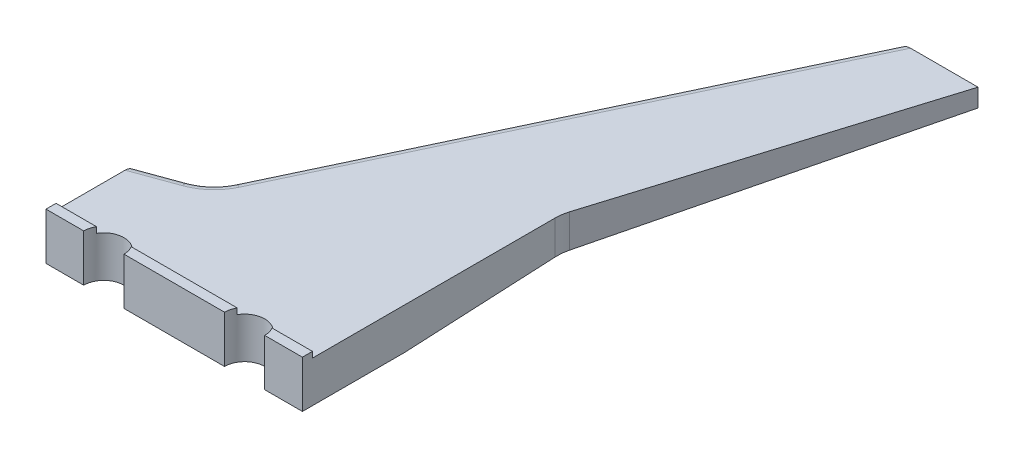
ISO-10303-21;
HEADER;
FILE_DESCRIPTION(('STEP AP214'),'2;1');
FILE_NAME('part.step','',(''),(''),'','','');
FILE_SCHEMA(('AUTOMOTIVE_DESIGN { 1 0 10303 214 1 1 1 1 }'));
ENDSEC;
DATA;
#1=APPLICATION_CONTEXT('core data for automotive mechanical design processes');
#2=APPLICATION_PROTOCOL_DEFINITION('international standard','automotive_design',2000,#1);
#3=PRODUCT_CONTEXT('',#1,'mechanical');
#4=PRODUCT('Part','Part','',(#3));
#5=PRODUCT_RELATED_PRODUCT_CATEGORY('part','',(#4));
#6=PRODUCT_DEFINITION_FORMATION('','',#4);
#7=PRODUCT_DEFINITION_CONTEXT('part definition',#1,'design');
#8=PRODUCT_DEFINITION('design','',#6,#7);
#9=PRODUCT_DEFINITION_SHAPE('','',#8);
#10=(LENGTH_UNIT() NAMED_UNIT(*) SI_UNIT(.MILLI.,.METRE.));
#11=(NAMED_UNIT(*) PLANE_ANGLE_UNIT() SI_UNIT($,.RADIAN.));
#12=(NAMED_UNIT(*) SI_UNIT($,.STERADIAN.) SOLID_ANGLE_UNIT());
#13=UNCERTAINTY_MEASURE_WITH_UNIT(LENGTH_MEASURE(1.E-05),#10,'distance_accuracy_value','');
#14=(GEOMETRIC_REPRESENTATION_CONTEXT(3) GLOBAL_UNCERTAINTY_ASSIGNED_CONTEXT((#13)) GLOBAL_UNIT_ASSIGNED_CONTEXT((#10,
#11,#12)) REPRESENTATION_CONTEXT('',''));
#15=CARTESIAN_POINT('',(0.,0.,0.));
#16=DIRECTION('',(0.,0.,1.));
#17=DIRECTION('',(1.,0.,0.));
#18=AXIS2_PLACEMENT_3D('',#15,#16,#17);
#19=CARTESIAN_POINT('',(62.5957803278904,9.35562767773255,15.8508650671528));
#20=DIRECTION('',(0.,0.,-1.));
#21=DIRECTION('',(-1.,0.,0.));
#22=AXIS2_PLACEMENT_3D('',#19,#20,#21);
#23=PLANE('',#22);
#24=DIRECTION('',(0.,-1.,0.));
#25=VECTOR('',#24,1.);
#26=CARTESIAN_POINT('',(42.9641016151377,9.35562767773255,15.8508650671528));
#27=LINE('',#26,#25);
#28=CARTESIAN_POINT('',(42.9641016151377,9.35562767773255,15.8508650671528));
#29=VERTEX_POINT('',#28);
#30=CARTESIAN_POINT('',(42.9641016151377,8.2,15.8508650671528));
#31=VERTEX_POINT('',#30);
#32=EDGE_CURVE('E722',#29,#31,#27,.T.);
#33=ORIENTED_EDGE('',*,*,#32,.F.);
#34=DIRECTION('',(-1.,0.,0.));
#35=VECTOR('',#34,1.);
#36=CARTESIAN_POINT('',(62.5957803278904,9.35562767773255,15.8508650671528));
#37=LINE('',#36,#35);
#38=CARTESIAN_POINT('',(51.,9.35562767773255,15.8508650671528));
#39=VERTEX_POINT('',#38);
#40=EDGE_CURVE('E438',#39,#29,#37,.T.);
#41=ORIENTED_EDGE('',*,*,#40,.F.);
#42=DIRECTION('',(0.,1.,0.));
#43=VECTOR('',#42,1.);
#44=CARTESIAN_POINT('',(51.,9.35562767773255,15.8508650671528));
#45=LINE('',#44,#43);
#46=CARTESIAN_POINT('',(51.,8.2,15.8508650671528));
#47=VERTEX_POINT('',#46);
#48=EDGE_CURVE('E454',#47,#39,#45,.T.);
#49=ORIENTED_EDGE('',*,*,#48,.F.);
#50=DIRECTION('',(-1.,0.,0.));
#51=VECTOR('',#50,1.);
#52=CARTESIAN_POINT('',(62.5957803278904,8.2,15.8508650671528));
#53=LINE('',#52,#51);
#54=EDGE_CURVE('E440',#47,#31,#53,.T.);
#55=ORIENTED_EDGE('',*,*,#54,.T.);
#56=EDGE_LOOP('',(#33,#41,#49,#55));
#57=FACE_BOUND('',#56,.T.);
#58=ADVANCED_FACE('F34',(#57),#23,.T.);
#59=CARTESIAN_POINT('',(62.5957803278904,9.35562767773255,17.8508650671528));
#60=DIRECTION('',(0.,1.,0.));
#61=DIRECTION('',(0.,0.,1.));
#62=AXIS2_PLACEMENT_3D('',#59,#60,#61);
#63=PLANE('',#62);
#64=CARTESIAN_POINT('',(39.5,9.35562767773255,17.8508650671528));
#65=DIRECTION('',(0.,-1.,0.));
#66=DIRECTION('',(0.,0.,-1.));
#67=AXIS2_PLACEMENT_3D('',#64,#65,#66);
#68=CIRCLE('',#67,4.00000000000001);
#69=CARTESIAN_POINT('',(43.5,9.35562767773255,17.8508650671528));
#70=VERTEX_POINT('',#69);
#71=EDGE_CURVE('E720',#29,#70,#68,.T.);
#72=ORIENTED_EDGE('',*,*,#71,.T.);
#73=DIRECTION('',(-1.,0.,0.));
#74=VECTOR('',#73,1.);
#75=CARTESIAN_POINT('',(62.5957803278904,9.35562767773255,17.8508650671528));
#76=LINE('',#75,#74);
#77=CARTESIAN_POINT('',(51.,9.35562767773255,17.8508650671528));
#78=VERTEX_POINT('',#77);
#79=EDGE_CURVE('E274',#78,#70,#76,.T.);
#80=ORIENTED_EDGE('',*,*,#79,.F.);
#81=DIRECTION('',(0.,0.,1.));
#82=VECTOR('',#81,1.);
#83=CARTESIAN_POINT('',(51.,9.35562767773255,17.8508650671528));
#84=LINE('',#83,#82);
#85=EDGE_CURVE('E449',#39,#78,#84,.T.);
#86=ORIENTED_EDGE('',*,*,#85,.F.);
#87=ORIENTED_EDGE('',*,*,#40,.T.);
#88=EDGE_LOOP('',(#72,#80,#86,#87));
#89=FACE_BOUND('',#88,.T.);
#90=ADVANCED_FACE('F392',(#89),#63,.T.);
#91=CARTESIAN_POINT('',(62.5957803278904,0.,17.8508650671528));
#92=DIRECTION('',(0.,0.,1.));
#93=DIRECTION('',(1.,0.,0.));
#94=AXIS2_PLACEMENT_3D('',#91,#92,#93);
#95=PLANE('',#94);
#96=DIRECTION('',(0.,-1.,0.));
#97=VECTOR('',#96,1.);
#98=CARTESIAN_POINT('',(35.5,9.35562767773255,17.8508650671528));
#99=LINE('',#98,#97);
#100=CARTESIAN_POINT('',(35.5,9.35562767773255,17.8508650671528));
#101=VERTEX_POINT('',#100);
#102=CARTESIAN_POINT('',(35.5,0.,17.8508650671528));
#103=VERTEX_POINT('',#102);
#104=EDGE_CURVE('E11',#101,#103,#99,.T.);
#105=ORIENTED_EDGE('',*,*,#104,.F.);
#106=CARTESIAN_POINT('',(15.5,9.35562767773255,17.8508650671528));
#107=VERTEX_POINT('',#106);
#108=EDGE_CURVE('E472',#101,#107,#76,.T.);
#109=ORIENTED_EDGE('',*,*,#108,.T.);
#110=DIRECTION('',(0.,-1.,0.));
#111=VECTOR('',#110,1.);
#112=CARTESIAN_POINT('',(15.5,9.35562767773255,17.8508650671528));
#113=LINE('',#112,#111);
#114=CARTESIAN_POINT('',(15.5,0.,17.8508650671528));
#115=VERTEX_POINT('',#114);
#116=EDGE_CURVE('E267',#115,#107,#113,.F.);
#117=ORIENTED_EDGE('',*,*,#116,.F.);
#118=DIRECTION('',(-1.,0.,0.));
#119=VECTOR('',#118,1.);
#120=CARTESIAN_POINT('',(62.5957803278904,0.,17.8508650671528));
#121=LINE('',#120,#119);
#122=EDGE_CURVE('E56',#103,#115,#121,.T.);
#123=ORIENTED_EDGE('',*,*,#122,.F.);
#124=EDGE_LOOP('',(#105,#109,#117,#123));
#125=FACE_BOUND('',#124,.T.);
#126=ADVANCED_FACE('F265',(#125),#95,.T.);
#127=DIRECTION('',(0.,-1.,0.));
#128=VECTOR('',#127,1.);
#129=CARTESIAN_POINT('',(36.0358983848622,9.35562767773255,15.8508650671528));
#130=LINE('',#129,#128);
#131=CARTESIAN_POINT('',(36.0358983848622,8.2,15.8508650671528));
#132=VERTEX_POINT('',#131);
#133=CARTESIAN_POINT('',(36.0358983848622,9.35562767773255,15.8508650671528));
#134=VERTEX_POINT('',#133);
#135=EDGE_CURVE('E719',#132,#134,#130,.F.);
#136=ORIENTED_EDGE('',*,*,#135,.F.);
#137=CARTESIAN_POINT('',(14.9641016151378,8.2,15.8508650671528));
#138=VERTEX_POINT('',#137);
#139=EDGE_CURVE('E437',#132,#138,#53,.T.);
#140=ORIENTED_EDGE('',*,*,#139,.T.);
#141=DIRECTION('',(0.,-1.,0.));
#142=VECTOR('',#141,1.);
#143=CARTESIAN_POINT('',(14.9641016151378,9.35562767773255,15.8508650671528));
#144=LINE('',#143,#142);
#145=CARTESIAN_POINT('',(14.9641016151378,9.35562767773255,15.8508650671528));
#146=VERTEX_POINT('',#145);
#147=EDGE_CURVE('E457',#146,#138,#144,.T.);
#148=ORIENTED_EDGE('',*,*,#147,.F.);
#149=EDGE_CURVE('E442',#134,#146,#37,.T.);
#150=ORIENTED_EDGE('',*,*,#149,.F.);
#151=EDGE_LOOP('',(#136,#140,#148,#150));
#152=FACE_BOUND('',#151,.T.);
#153=ADVANCED_FACE('F395',(#152),#23,.T.);
#154=EDGE_CURVE('E256',#101,#134,#68,.T.);
#155=ORIENTED_EDGE('',*,*,#154,.T.);
#156=ORIENTED_EDGE('',*,*,#149,.T.);
#157=CARTESIAN_POINT('',(11.5,9.35562767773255,17.8508650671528));
#158=DIRECTION('',(0.,-1.,0.));
#159=DIRECTION('',(0.,0.,-1.));
#160=AXIS2_PLACEMENT_3D('',#157,#158,#159);
#161=CIRCLE('',#160,4.);
#162=EDGE_CURVE('E429',#146,#107,#161,.T.);
#163=ORIENTED_EDGE('',*,*,#162,.T.);
#164=ORIENTED_EDGE('',*,*,#108,.F.);
#165=EDGE_LOOP('',(#155,#156,#163,#164));
#166=FACE_BOUND('',#165,.T.);
#167=ADVANCED_FACE('F402',(#166),#63,.T.);
#168=DIRECTION('',(0.,-1.,0.));
#169=VECTOR('',#168,1.);
#170=CARTESIAN_POINT('',(7.5,9.35562767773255,17.8508650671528));
#171=LINE('',#170,#169);
#172=CARTESIAN_POINT('',(7.5,9.35562767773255,17.8508650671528));
#173=VERTEX_POINT('',#172);
#174=CARTESIAN_POINT('',(7.5,0.,17.8508650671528));
#175=VERTEX_POINT('',#174);
#176=EDGE_CURVE('E479',#173,#175,#171,.T.);
#177=ORIENTED_EDGE('',*,*,#176,.F.);
#178=CARTESIAN_POINT('',(0.,9.35562767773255,17.8508650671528));
#179=VERTEX_POINT('',#178);
#180=EDGE_CURVE('E270',#173,#179,#76,.T.);
#181=ORIENTED_EDGE('',*,*,#180,.T.);
#182=DIRECTION('',(0.,1.,0.));
#183=VECTOR('',#182,1.);
#184=CARTESIAN_POINT('',(0.,0.,17.8508650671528));
#185=LINE('',#184,#183);
#186=CARTESIAN_POINT('',(0.,0.,17.8508650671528));
#187=VERTEX_POINT('',#186);
#188=EDGE_CURVE('E461',#187,#179,#185,.T.);
#189=ORIENTED_EDGE('',*,*,#188,.F.);
#190=EDGE_CURVE('E268',#175,#187,#121,.T.);
#191=ORIENTED_EDGE('',*,*,#190,.F.);
#192=EDGE_LOOP('',(#177,#181,#189,#191));
#193=FACE_BOUND('',#192,.T.);
#194=ADVANCED_FACE('F477',(#193),#95,.T.);
#195=CARTESIAN_POINT('',(51.,8.2,-33.7));
#196=DIRECTION('',(-0.955609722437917,0.,-0.294635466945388));
#197=DIRECTION('',(-0.294635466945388,0.,0.955609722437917));
#198=AXIS2_PLACEMENT_3D('',#195,#196,#197);
#199=PLANE('',#198);
#200=DIRECTION('',(0.,-1.,0.));
#201=VECTOR('',#200,1.);
#202=CARTESIAN_POINT('',(51.3773173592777,0.,-34.9237770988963));
#203=LINE('',#202,#201);
#204=CARTESIAN_POINT('',(51.3773173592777,8.2,-34.9237770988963));
#205=VERTEX_POINT('',#204);
#206=CARTESIAN_POINT('',(51.3773173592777,1.58970920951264,-34.9237770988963));
#207=VERTEX_POINT('',#206);
#208=EDGE_CURVE('E307',#205,#207,#203,.T.);
#209=ORIENTED_EDGE('',*,*,#208,.T.);
#210=CARTESIAN_POINT('',(51.3773173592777,1.58970920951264,-34.9237770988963));
#211=CARTESIAN_POINT('',(57.6017700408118,2.57295109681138,-55.1119355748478));
#212=CARTESIAN_POINT('',(63.826262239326,3.55329832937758,-75.3002222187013));
#213=CARTESIAN_POINT('',(70.2061227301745,4.55514254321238,-95.9924246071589));
#214=CARTESIAN_POINT('',(70.3614515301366,4.57953237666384,-96.4962122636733));
#215=CARTESIAN_POINT('',(70.5167803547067,4.60392040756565,-97.));
#216=B_SPLINE_CURVE_WITH_KNOTS('',3,(#210,#211,#212,#213,#214,#215),.UNSPECIFIED.,.F.,.F.,(4,2,
4),(0.,63.4464397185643,65.0297006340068),.UNSPECIFIED.);
#217=CARTESIAN_POINT('',(70.5167803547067,4.60392040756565,-97.));
#218=VERTEX_POINT('',#217);
#219=EDGE_CURVE('E344',#207,#218,#216,.T.);
#220=ORIENTED_EDGE('',*,*,#219,.T.);
#221=DIRECTION('',(0.,-1.,0.));
#222=VECTOR('',#221,1.);
#223=CARTESIAN_POINT('',(70.5167803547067,8.2,-97.));
#224=LINE('',#223,#222);
#225=CARTESIAN_POINT('',(70.5167803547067,8.2,-97.));
#226=VERTEX_POINT('',#225);
#227=EDGE_CURVE('E349',#226,#218,#224,.T.);
#228=ORIENTED_EDGE('',*,*,#227,.F.);
#229=DIRECTION('',(0.294635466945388,0.,-0.955609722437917));
#230=VECTOR('',#229,1.);
#231=CARTESIAN_POINT('',(51.,8.2,-33.7));
#232=LINE('',#231,#230);
#233=EDGE_CURVE('E657',#205,#226,#232,.T.);
#234=ORIENTED_EDGE('',*,*,#233,.F.);
#235=EDGE_LOOP('',(#209,#220,#228,#234));
#236=FACE_BOUND('',#235,.T.);
#237=ADVANCED_FACE('F332',(#236),#199,.F.);
#238=CARTESIAN_POINT('',(11.,8.2,-4.00367257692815));
#239=DIRECTION('',(0.342020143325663,0.,0.93969262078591));
#240=DIRECTION('',(0.939692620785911,0.,-0.342020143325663));
#241=AXIS2_PLACEMENT_3D('',#238,#239,#240);
#242=PLANE('',#241);
#243=DIRECTION('',(0.,-1.,0.));
#244=VECTOR('',#243,1.);
#245=CARTESIAN_POINT('',(1.31595971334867,8.2,-0.478970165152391));
#246=LINE('',#245,#244);
#247=CARTESIAN_POINT('',(1.31595971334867,0.,-0.478970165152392));
#248=VERTEX_POINT('',#247);
#249=CARTESIAN_POINT('',(1.31595971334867,6.2,-0.478970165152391));
#250=VERTEX_POINT('',#249);
#251=EDGE_CURVE('E357',#248,#250,#246,.F.);
#252=ORIENTED_EDGE('',*,*,#251,.T.);
#253=DIRECTION('',(-0.939692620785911,0.,0.342020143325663));
#254=VECTOR('',#253,1.);
#255=CARTESIAN_POINT('',(11.,6.2,-4.00367257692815));
#256=LINE('',#255,#254);
#257=CARTESIAN_POINT('',(7.71279497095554,6.2,-2.80722779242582));
#258=VERTEX_POINT('',#257);
#259=EDGE_CURVE('E557',#250,#258,#256,.F.);
#260=ORIENTED_EDGE('',*,*,#259,.T.);
#261=DIRECTION('',(0.,-1.,0.));
#262=VECTOR('',#261,1.);
#263=CARTESIAN_POINT('',(7.71279497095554,0.,-2.80722779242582));
#264=LINE('',#263,#262);
#265=CARTESIAN_POINT('',(7.71279497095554,0.,-2.80722779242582));
#266=VERTEX_POINT('',#265);
#267=EDGE_CURVE('E654',#258,#266,#264,.T.);
#268=ORIENTED_EDGE('',*,*,#267,.T.);
#269=DIRECTION('',(-0.93969262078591,0.,0.342020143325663));
#270=VECTOR('',#269,1.);
#271=CARTESIAN_POINT('',(11.,0.,-4.00367257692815));
#272=LINE('',#271,#270);
#273=EDGE_CURVE('E651',#266,#248,#272,.T.);
#274=ORIENTED_EDGE('',*,*,#273,.T.);
#275=EDGE_LOOP('',(#252,#260,#268,#274));
#276=FACE_BOUND('',#275,.T.);
#277=ADVANCED_FACE('F686',(#276),#242,.F.);
#278=CARTESIAN_POINT('',(51.,8.2,0.));
#279=DIRECTION('',(-1.,0.,0.));
#280=DIRECTION('',(0.,0.,1.));
#281=AXIS2_PLACEMENT_3D('',#278,#279,#280);
#282=PLANE('',#281);
#283=DIRECTION('',(0.,0.,-1.));
#284=VECTOR('',#283,1.);
#285=CARTESIAN_POINT('',(51.,0.,0.));
#286=LINE('',#285,#284);
#287=CARTESIAN_POINT('',(51.,0.,17.8508650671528));
#288=VERTEX_POINT('',#287);
#289=CARTESIAN_POINT('',(51.,0.,-2.46774148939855));
#290=VERTEX_POINT('',#289);
#291=EDGE_CURVE('E649',#288,#290,#286,.T.);
#292=ORIENTED_EDGE('',*,*,#291,.T.);
#293=CARTESIAN_POINT('',(51.,0.,-2.46774148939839));
#294=CARTESIAN_POINT('',(51.,0.128135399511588,-4.96342560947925));
#295=CARTESIAN_POINT('',(51.,0.254728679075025,-7.45918863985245));
#296=CARTESIAN_POINT('',(51.,0.505039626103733,-12.4508560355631));
#297=CARTESIAN_POINT('',(51.,0.628757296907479,-14.946760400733));
#298=CARTESIAN_POINT('',(51.,0.873526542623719,-19.9387118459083));
#299=CARTESIAN_POINT('',(51.,0.994578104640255,-22.4347589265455));
#300=CARTESIAN_POINT('',(51.,1.23415525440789,-27.4269772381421));
#301=CARTESIAN_POINT('',(51.,1.3526808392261,-29.9231484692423));
#302=CARTESIAN_POINT('',(51.,1.47001366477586,-32.4193756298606));
#303=B_SPLINE_CURVE_WITH_KNOTS('',3,(#293,#294,#295,#296,#297,#298,#299,#300,#301,#302),
.UNSPECIFIED.,.F.,.F.,(4,2,2,2,4),(0.,7.49691324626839,14.9938177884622,22.4907585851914,
29.9877080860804),.UNSPECIFIED.);
#304=CARTESIAN_POINT('',(51.,1.47001366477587,-32.4193756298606));
#305=VERTEX_POINT('',#304);
#306=EDGE_CURVE('E638',#290,#305,#303,.T.);
#307=ORIENTED_EDGE('',*,*,#306,.T.);
#308=DIRECTION('',(0.,-1.,0.));
#309=VECTOR('',#308,1.);
#310=CARTESIAN_POINT('',(51.,8.2,-32.4193756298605));
#311=LINE('',#310,#309);
#312=CARTESIAN_POINT('',(51.,8.2,-32.4193756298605));
#313=VERTEX_POINT('',#312);
#314=EDGE_CURVE('E353',#305,#313,#311,.F.);
#315=ORIENTED_EDGE('',*,*,#314,.T.);
#316=DIRECTION('',(0.,0.,-1.));
#317=VECTOR('',#316,1.);
#318=CARTESIAN_POINT('',(51.,8.2,0.));
#319=LINE('',#318,#317);
#320=EDGE_CURVE('E644',#47,#313,#319,.T.);
#321=ORIENTED_EDGE('',*,*,#320,.F.);
#322=ORIENTED_EDGE('',*,*,#48,.T.);
#323=ORIENTED_EDGE('',*,*,#85,.T.);
#324=DIRECTION('',(0.,-1.,0.));
#325=VECTOR('',#324,1.);
#326=CARTESIAN_POINT('',(51.,0.,17.8508650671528));
#327=LINE('',#326,#325);
#328=EDGE_CURVE('E445',#78,#288,#327,.T.);
#329=ORIENTED_EDGE('',*,*,#328,.T.);
#330=EDGE_LOOP('',(#292,#307,#315,#321,#322,#323,#329));
#331=FACE_BOUND('',#330,.T.);
#332=ADVANCED_FACE('F675',(#331),#282,.F.);
#333=CARTESIAN_POINT('',(54.8813851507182,8.2,-97.));
#334=DIRECTION('',(0.,0.,1.));
#335=DIRECTION('',(1.,0.,0.));
#336=AXIS2_PLACEMENT_3D('',#333,#334,#335);
#337=PLANE('',#336);
#338=CARTESIAN_POINT('',(70.5167803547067,4.60392040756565,-97.));
#339=CARTESIAN_POINT('',(69.6480622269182,4.59513245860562,-97.));
#340=CARTESIAN_POINT('',(68.7793535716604,4.58541360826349,-97.));
#341=CARTESIAN_POINT('',(67.0419664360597,4.56413689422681,-97.));
#342=CARTESIAN_POINT('',(66.1732879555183,4.5525790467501,-97.));
#343=CARTESIAN_POINT('',(64.435960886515,4.52764702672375,-97.));
#344=CARTESIAN_POINT('',(63.5673122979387,4.51427286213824,-97.));
#345=CARTESIAN_POINT('',(61.8300448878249,4.4857138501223,-97.));
#346=CARTESIAN_POINT('',(60.9614260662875,4.47052900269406,-97.));
#347=CARTESIAN_POINT('',(59.2242182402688,4.43834336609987,-97.));
#348=CARTESIAN_POINT('',(58.3556292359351,4.42134256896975,-97.));
#349=CARTESIAN_POINT('',(56.6184814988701,4.385502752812,-97.));
#350=CARTESIAN_POINT('',(55.7499227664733,4.36666371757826,-97.));
#351=CARTESIAN_POINT('',(54.8813851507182,4.34689454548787,-97.));
#352=B_SPLINE_CURVE_WITH_KNOTS('',3,(#338,#339,#340,#341,#342,#343,#344,#345,#346,#347,#348,
#349,#350,#351),.UNSPECIFIED.,.F.,.F.,(4,2,2,2,2,2,4),(0.,2.60628714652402,5.21255130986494,
7.81880404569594,10.425056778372,13.03132094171,15.637608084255),.UNSPECIFIED.);
#353=CARTESIAN_POINT('',(64.8813851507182,4.53396737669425,-97.));
#354=VERTEX_POINT('',#353);
#355=EDGE_CURVE('E666',#218,#354,#352,.T.);
#356=ORIENTED_EDGE('',*,*,#355,.T.);
#357=DIRECTION('',(0.,-1.,0.));
#358=VECTOR('',#357,1.);
#359=CARTESIAN_POINT('',(64.8813851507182,6.59689454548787,-97.));
#360=LINE('',#359,#358);
#361=CARTESIAN_POINT('',(64.8813851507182,6.59689454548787,-97.));
#362=VERTEX_POINT('',#361);
#363=EDGE_CURVE('E283',#362,#354,#360,.T.);
#364=ORIENTED_EDGE('',*,*,#363,.F.);
#365=DIRECTION('',(1.,0.,0.));
#366=VECTOR('',#365,1.);
#367=CARTESIAN_POINT('',(57.8813851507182,6.59689454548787,-97.));
#368=LINE('',#367,#366);
#369=CARTESIAN_POINT('',(57.8813851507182,6.59689454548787,-97.));
#370=VERTEX_POINT('',#369);
#371=EDGE_CURVE('E279',#370,#362,#368,.T.);
#372=ORIENTED_EDGE('',*,*,#371,.F.);
#373=DIRECTION('',(0.,1.,0.));
#374=VECTOR('',#373,1.);
#375=CARTESIAN_POINT('',(57.8813851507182,1.59689454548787,-97.));
#376=LINE('',#375,#374);
#377=CARTESIAN_POINT('',(57.8813851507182,4.41149486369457,-97.));
#378=VERTEX_POINT('',#377);
#379=EDGE_CURVE('E276',#378,#370,#376,.T.);
#380=ORIENTED_EDGE('',*,*,#379,.F.);
#381=CARTESIAN_POINT('',(54.8813851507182,4.34689454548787,-97.));
#382=VERTEX_POINT('',#381);
#383=EDGE_CURVE('E352',#378,#382,#352,.T.);
#384=ORIENTED_EDGE('',*,*,#383,.T.);
#385=DIRECTION('',(0.,-1.,0.));
#386=VECTOR('',#385,1.);
#387=CARTESIAN_POINT('',(54.8813851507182,8.2,-97.));
#388=LINE('',#387,#386);
#389=CARTESIAN_POINT('',(54.8813851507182,6.2,-97.));
#390=VERTEX_POINT('',#389);
#391=EDGE_CURVE('E634',#390,#382,#388,.T.);
#392=ORIENTED_EDGE('',*,*,#391,.F.);
#393=CARTESIAN_POINT('',(57.0928581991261,6.2,-97.));
#394=DIRECTION('',(0.,0.,1.));
#395=DIRECTION('',(-1.,0.,0.));
#396=AXIS2_PLACEMENT_3D('',#393,#394,#395);
#397=ELLIPSE('',#396,2.2114730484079,2.);
#398=CARTESIAN_POINT('',(57.0928581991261,8.2,-97.));
#399=VERTEX_POINT('',#398);
#400=EDGE_CURVE('E563',#390,#399,#397,.F.);
#401=ORIENTED_EDGE('',*,*,#400,.T.);
#402=DIRECTION('',(-1.,0.,0.));
#403=VECTOR('',#402,1.);
#404=CARTESIAN_POINT('',(54.8813851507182,8.2,-97.));
#405=LINE('',#404,#403);
#406=EDGE_CURVE('E343',#226,#399,#405,.T.);
#407=ORIENTED_EDGE('',*,*,#406,.F.);
#408=ORIENTED_EDGE('',*,*,#227,.T.);
#409=EDGE_LOOP('',(#356,#364,#372,#380,#384,#392,#401,#407,#408));
#410=FACE_BOUND('',#409,.T.);
#411=ADVANCED_FACE('F674',(#410),#337,.F.);
#412=CARTESIAN_POINT('',(54.8813851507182,8.2,-97.));
#413=DIRECTION('',(0.904374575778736,0.,0.42673953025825));
#414=DIRECTION('',(0.42673953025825,0.,-0.904374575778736));
#415=AXIS2_PLACEMENT_3D('',#412,#413,#414);
#416=PLANE('',#415);
#417=DIRECTION('',(0.,-1.,0.));
#418=VECTOR('',#417,1.);
#419=CARTESIAN_POINT('',(12.4928076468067,8.2,-7.16732906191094));
#420=LINE('',#419,#418);
#421=CARTESIAN_POINT('',(12.4928076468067,0.,-7.16732906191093));
#422=VERTEX_POINT('',#421);
#423=CARTESIAN_POINT('',(12.4928076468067,6.2,-7.16732906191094));
#424=VERTEX_POINT('',#423);
#425=EDGE_CURVE('E642',#422,#424,#420,.F.);
#426=ORIENTED_EDGE('',*,*,#425,.T.);
#427=DIRECTION('',(-0.42673953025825,0.,0.904374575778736));
#428=VECTOR('',#427,1.);
#429=CARTESIAN_POINT('',(54.8813851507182,6.2,-97.));
#430=LINE('',#429,#428);
#431=EDGE_CURVE('E561',#424,#390,#430,.F.);
#432=ORIENTED_EDGE('',*,*,#431,.T.);
#433=ORIENTED_EDGE('',*,*,#391,.T.);
#434=CARTESIAN_POINT('',(54.8813851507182,4.34689454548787,-97.));
#435=CARTESIAN_POINT('',(49.7207880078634,3.78713622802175,-86.0633219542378));
#436=CARTESIAN_POINT('',(44.5602134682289,3.22623287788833,-75.1266918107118));
#437=CARTESIAN_POINT('',(34.2391117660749,2.10204449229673,-53.2535319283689));
#438=CARTESIAN_POINT('',(29.0785846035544,1.53875945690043,-42.3170021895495));
#439=CARTESIAN_POINT('',(20.953217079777,0.649902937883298,-25.0971870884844));
#440=CARTESIAN_POINT('',(17.9883602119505,0.325159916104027,-18.8138667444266));
#441=CARTESIAN_POINT('',(15.0235116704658,0.,-12.5305640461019));
#442=B_SPLINE_CURVE_WITH_KNOTS('',3,(#434,#435,#436,#437,#438,#439,#440,#441),.UNSPECIFIED.,.F.,
.F.,(4,2,2,4),(0.,36.3180970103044,72.6361930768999,93.5020392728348),.UNSPECIFIED.);
#443=CARTESIAN_POINT('',(23.7385271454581,0.954595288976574,-31.));
#444=VERTEX_POINT('',#443);
#445=EDGE_CURVE('E633',#382,#444,#442,.T.);
#446=ORIENTED_EDGE('',*,*,#445,.T.);
#447=DIRECTION('',(0.,1.,0.));
#448=VECTOR('',#447,1.);
#449=CARTESIAN_POINT('',(23.7385271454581,8.2,-31.));
#450=LINE('',#449,#448);
#451=CARTESIAN_POINT('',(23.7385271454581,3.,-31.));
#452=VERTEX_POINT('',#451);
#453=EDGE_CURVE('E293',#444,#452,#450,.T.);
#454=ORIENTED_EDGE('',*,*,#453,.T.);
#455=CARTESIAN_POINT('',(23.2666656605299,3.,-30.));
#456=DIRECTION('',(0.904374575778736,0.,0.42673953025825));
#457=DIRECTION('',(0.42673953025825,0.,-0.904374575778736));
#458=AXIS2_PLACEMENT_3D('',#455,#456,#457);
#459=ELLIPSE('',#458,1.10573652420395,1.);
#460=CARTESIAN_POINT('',(23.2666656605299,4.,-30.));
#461=VERTEX_POINT('',#460);
#462=EDGE_CURVE('E526',#452,#461,#459,.T.);
#463=ORIENTED_EDGE('',*,*,#462,.T.);
#464=DIRECTION('',(0.42673953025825,0.,-0.904374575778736));
#465=VECTOR('',#464,1.);
#466=CARTESIAN_POINT('',(54.8813851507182,4.,-97.));
#467=LINE('',#466,#465);
#468=CARTESIAN_POINT('',(21.8510812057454,4.,-27.));
#469=VERTEX_POINT('',#468);
#470=EDGE_CURVE('E602',#469,#461,#467,.T.);
#471=ORIENTED_EDGE('',*,*,#470,.F.);
#472=CARTESIAN_POINT('',(21.8510812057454,3.,-27.));
#473=DIRECTION('',(0.904374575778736,0.,0.42673953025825));
#474=DIRECTION('',(-0.42673953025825,0.,0.904374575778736));
#475=AXIS2_PLACEMENT_3D('',#472,#473,#474);
#476=ELLIPSE('',#475,1.10573652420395,1.);
#477=CARTESIAN_POINT('',(21.3792197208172,3.,-26.));
#478=VERTEX_POINT('',#477);
#479=EDGE_CURVE('E534',#469,#478,#476,.T.);
#480=ORIENTED_EDGE('',*,*,#479,.T.);
#481=DIRECTION('',(0.,-1.,0.));
#482=VECTOR('',#481,1.);
#483=CARTESIAN_POINT('',(21.3792197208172,8.2,-26.));
#484=LINE('',#483,#482);
#485=CARTESIAN_POINT('',(21.3792197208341,0.696404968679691,-26.));
#486=VERTEX_POINT('',#485);
#487=EDGE_CURVE('E299',#478,#486,#484,.T.);
#488=ORIENTED_EDGE('',*,*,#487,.T.);
#489=CARTESIAN_POINT('',(15.0235116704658,0.,-12.5305640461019));
#490=VERTEX_POINT('',#489);
#491=EDGE_CURVE('E622',#486,#490,#442,.T.);
#492=ORIENTED_EDGE('',*,*,#491,.T.);
#493=DIRECTION('',(-0.42673953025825,0.,0.904374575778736));
#494=VECTOR('',#493,1.);
#495=CARTESIAN_POINT('',(54.8813851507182,0.,-97.));
#496=LINE('',#495,#494);
#497=EDGE_CURVE('E631',#490,#422,#496,.T.);
#498=ORIENTED_EDGE('',*,*,#497,.T.);
#499=EDGE_LOOP('',(#426,#432,#433,#446,#454,#463,#471,#480,#488,#492,#498));
#500=FACE_BOUND('',#499,.T.);
#501=ADVANCED_FACE('F629',(#500),#416,.F.);
#502=CARTESIAN_POINT('',(51.,8.2,-18.562481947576));
#503=DIRECTION('',(0.,-1.,0.));
#504=DIRECTION('',(0.,0.,-1.));
#505=AXIS2_PLACEMENT_3D('',#502,#503,#504);
#506=PLANE('',#505);
#507=ORIENTED_EDGE('',*,*,#139,.F.);
#508=CARTESIAN_POINT('',(39.5,8.2,17.8508650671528));
#509=DIRECTION('',(0.,-1.,0.));
#510=DIRECTION('',(0.,0.,-1.));
#511=AXIS2_PLACEMENT_3D('',#508,#509,#510);
#512=CIRCLE('',#511,4.00000000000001);
#513=EDGE_CURVE('E717',#132,#31,#512,.T.);
#514=ORIENTED_EDGE('',*,*,#513,.T.);
#515=ORIENTED_EDGE('',*,*,#54,.F.);
#516=ORIENTED_EDGE('',*,*,#320,.T.);
#517=CARTESIAN_POINT('',(59.5,8.2,-32.4193756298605));
#518=DIRECTION('',(0.,-1.,0.));
#519=DIRECTION('',(0.,0.,-1.));
#520=AXIS2_PLACEMENT_3D('',#517,#518,#519);
#521=CIRCLE('',#520,8.5);
#522=EDGE_CURVE('E659',#313,#205,#521,.T.);
#523=ORIENTED_EDGE('',*,*,#522,.T.);
#524=ORIENTED_EDGE('',*,*,#233,.T.);
#525=ORIENTED_EDGE('',*,*,#406,.T.);
#526=DIRECTION('',(-0.42673953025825,0.,0.904374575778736));
#527=VECTOR('',#526,1.);
#528=CARTESIAN_POINT('',(25.7117301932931,8.2,-30.4950424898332));
#529=LINE('',#528,#527);
#530=CARTESIAN_POINT('',(14.3015567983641,8.2,-6.31385000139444));
#531=VERTEX_POINT('',#530);
#532=EDGE_CURVE('E537',#399,#531,#529,.T.);
#533=ORIENTED_EDGE('',*,*,#532,.T.);
#534=CARTESIAN_POINT('',(4.8056237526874,8.2,-10.7946150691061));
#535=DIRECTION('',(0.,-1.,0.));
#536=DIRECTION('',(0.,0.,-1.));
#537=AXIS2_PLACEMENT_3D('',#534,#535,#536);
#538=CIRCLE('',#537,10.5);
#539=CARTESIAN_POINT('',(8.39683525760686,8.2,-0.927842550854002));
#540=VERTEX_POINT('',#539);
#541=EDGE_CURVE('E549',#531,#540,#538,.T.);
#542=ORIENTED_EDGE('',*,*,#541,.T.);
#543=DIRECTION('',(-0.939692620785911,0.,0.342020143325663));
#544=VECTOR('',#543,1.);
#545=CARTESIAN_POINT('',(51.6840402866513,8.2,-16.6830967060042));
#546=LINE('',#545,#544);
#547=CARTESIAN_POINT('',(0.,8.2,2.12835554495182));
#548=VERTEX_POINT('',#547);
#549=EDGE_CURVE('E551',#540,#548,#546,.T.);
#550=ORIENTED_EDGE('',*,*,#549,.T.);
#551=DIRECTION('',(0.,0.,-1.));
#552=VECTOR('',#551,1.);
#553=CARTESIAN_POINT('',(0.,8.2,11.));
#554=LINE('',#553,#552);
#555=CARTESIAN_POINT('',(0.,8.2,15.8508650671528));
#556=VERTEX_POINT('',#555);
#557=EDGE_CURVE('E301',#556,#548,#554,.T.);
#558=ORIENTED_EDGE('',*,*,#557,.F.);
#559=CARTESIAN_POINT('',(8.03589838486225,8.2,15.8508650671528));
#560=VERTEX_POINT('',#559);
#561=EDGE_CURVE('E423',#560,#556,#53,.T.);
#562=ORIENTED_EDGE('',*,*,#561,.F.);
#563=CARTESIAN_POINT('',(11.5,8.2,17.8508650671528));
#564=DIRECTION('',(0.,-1.,0.));
#565=DIRECTION('',(0.,0.,-1.));
#566=AXIS2_PLACEMENT_3D('',#563,#564,#565);
#567=CIRCLE('',#566,4.);
#568=EDGE_CURVE('E428',#560,#138,#567,.T.);
#569=ORIENTED_EDGE('',*,*,#568,.T.);
#570=EDGE_LOOP('',(#507,#514,#515,#516,#523,#524,#525,#533,#542,#550,#558,#562,#569));
#571=FACE_BOUND('',#570,.T.);
#572=ADVANCED_FACE('F434',(#571),#506,.F.);
#573=CARTESIAN_POINT('',(51.,0.,-18.562481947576));
#574=DIRECTION('',(0.,-1.,0.));
#575=DIRECTION('',(0.,0.,-1.));
#576=AXIS2_PLACEMENT_3D('',#573,#574,#575);
#577=PLANE('',#576);
#578=CARTESIAN_POINT('',(39.5,0.,17.8508650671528));
#579=DIRECTION('',(0.,-1.,0.));
#580=DIRECTION('',(0.,0.,-1.));
#581=AXIS2_PLACEMENT_3D('',#578,#579,#580);
#582=CIRCLE('',#581,4.00000000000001);
#583=CARTESIAN_POINT('',(43.5,0.,17.8508650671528));
#584=VERTEX_POINT('',#583);
#585=EDGE_CURVE('E49',#103,#584,#582,.T.);
#586=ORIENTED_EDGE('',*,*,#585,.F.);
#587=ORIENTED_EDGE('',*,*,#122,.T.);
#588=CARTESIAN_POINT('',(11.5,0.,17.8508650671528));
#589=DIRECTION('',(0.,-1.,0.));
#590=DIRECTION('',(0.,0.,-1.));
#591=AXIS2_PLACEMENT_3D('',#588,#589,#590);
#592=CIRCLE('',#591,4.);
#593=EDGE_CURVE('E728',#175,#115,#592,.T.);
#594=ORIENTED_EDGE('',*,*,#593,.F.);
#595=ORIENTED_EDGE('',*,*,#190,.T.);
#596=DIRECTION('',(0.,0.,-1.));
#597=VECTOR('',#596,1.);
#598=CARTESIAN_POINT('',(0.,0.,11.));
#599=LINE('',#598,#597);
#600=CARTESIAN_POINT('',(0.,0.,1.40041507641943));
#601=VERTEX_POINT('',#600);
#602=EDGE_CURVE('E304',#187,#601,#599,.T.);
#603=ORIENTED_EDGE('',*,*,#602,.T.);
#604=CARTESIAN_POINT('',(2.,0.,1.40041507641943));
#605=DIRECTION('',(0.,-1.,0.));
#606=DIRECTION('',(0.,0.,-1.));
#607=AXIS2_PLACEMENT_3D('',#604,#605,#606);
#608=CIRCLE('',#607,2.);
#609=EDGE_CURVE('E355',#601,#248,#608,.T.);
#610=ORIENTED_EDGE('',*,*,#609,.T.);
#611=ORIENTED_EDGE('',*,*,#273,.F.);
#612=CARTESIAN_POINT('',(4.8056237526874,0.,-10.7946150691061));
#613=DIRECTION('',(0.,-1.,0.));
#614=DIRECTION('',(0.,0.,-1.));
#615=AXIS2_PLACEMENT_3D('',#612,#613,#614);
#616=CIRCLE('',#615,8.5);
#617=EDGE_CURVE('E317',#266,#422,#616,.F.);
#618=ORIENTED_EDGE('',*,*,#617,.T.);
#619=ORIENTED_EDGE('',*,*,#497,.F.);
#620=CARTESIAN_POINT('',(45.5050049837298,0.,-52.1648745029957));
#621=DIRECTION('',(0.,1.,0.));
#622=DIRECTION('',(0.,0.,1.));
#623=AXIS2_PLACEMENT_3D('',#620,#621,#622);
#624=CIRCLE('',#623,50.);
#625=EDGE_CURVE('E339',#490,#290,#624,.T.);
#626=ORIENTED_EDGE('',*,*,#625,.T.);
#627=ORIENTED_EDGE('',*,*,#291,.F.);
#628=EDGE_CURVE('E262',#288,#584,#121,.T.);
#629=ORIENTED_EDGE('',*,*,#628,.T.);
#630=EDGE_LOOP('',(#586,#587,#594,#595,#603,#610,#611,#618,#619,#626,#627,#629));
#631=FACE_BOUND('',#630,.T.);
#632=ADVANCED_FACE('F260',(#631),#577,.T.);
#633=CARTESIAN_POINT('',(59.5,8.2,-32.4193756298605));
#634=DIRECTION('',(0.,1.,0.));
#635=DIRECTION('',(0.,0.,1.));
#636=AXIS2_PLACEMENT_3D('',#633,#634,#635);
#637=CYLINDRICAL_SURFACE('',#636,8.5);
#638=ORIENTED_EDGE('',*,*,#314,.F.);
#639=CARTESIAN_POINT('',(51.,1.47001366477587,-32.4193756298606));
#640=CARTESIAN_POINT('',(50.9999995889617,1.47401779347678,-32.5045667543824));
#641=CARTESIAN_POINT('',(51.0012807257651,1.47802776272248,-32.5897575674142));
#642=CARTESIAN_POINT('',(51.006393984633,1.4860420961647,-32.7597591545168));
#643=CARTESIAN_POINT('',(51.0102170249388,1.49004642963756,-32.8445702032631));
#644=CARTESIAN_POINT('',(51.0203884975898,1.49805004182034,-33.0138138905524));
#645=CARTESIAN_POINT('',(51.0267301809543,1.50204930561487,-33.0982469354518));
#646=CARTESIAN_POINT('',(51.0419196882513,1.51004327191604,-33.2667358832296));
#647=CARTESIAN_POINT('',(51.0507630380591,1.51403796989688,-33.3507921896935));
#648=CARTESIAN_POINT('',(51.070943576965,1.52202326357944,-33.5185285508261));
#649=CARTESIAN_POINT('',(51.0822785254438,1.52601385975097,-33.6022088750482));
#650=CARTESIAN_POINT('',(51.1074367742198,1.53399142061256,-33.7691948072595));
#651=CARTESIAN_POINT('',(51.1212600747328,1.53797838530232,-33.8525004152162));
#652=CARTESIAN_POINT('',(51.1513963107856,1.54594909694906,-34.0187375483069));
#653=CARTESIAN_POINT('',(51.1677114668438,1.54993283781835,-34.1016686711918));
#654=CARTESIAN_POINT('',(51.202839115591,1.55789738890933,-34.2671551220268));
#655=CARTESIAN_POINT('',(51.2216560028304,1.56187818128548,-34.3497095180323));
#656=CARTESIAN_POINT('',(51.2618015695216,1.5698370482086,-34.5144393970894));
#657=CARTESIAN_POINT('',(51.2831368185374,1.5738150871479,-34.5966132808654));
#658=CARTESIAN_POINT('',(51.3283397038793,1.58176857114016,-34.7605777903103));
#659=CARTESIAN_POINT('',(51.3522161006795,1.58574395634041,-34.842366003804));
#660=CARTESIAN_POINT('',(51.3773173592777,1.58970920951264,-34.9237770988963));
#661=B_SPLINE_CURVE_WITH_KNOTS('',3,(#639,#640,#641,#642,#643,#644,#645,#646,#647,#648,#649,
#650,#651,#652,#653,#654,#655,#656,#657,#658,#659,#660),.UNSPECIFIED.,.F.,.F.,(4,2,2,2,2,2,2,2,
2,2,4),(0.,0.255845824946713,0.510782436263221,0.765040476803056,1.01884663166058,
1.27242547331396,1.52600433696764,1.77981050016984,2.03406854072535,2.28900515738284,
2.54485101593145),.UNSPECIFIED.);
#662=EDGE_CURVE('E308',#305,#207,#661,.T.);
#663=ORIENTED_EDGE('',*,*,#662,.T.);
#664=ORIENTED_EDGE('',*,*,#208,.F.);
#665=ORIENTED_EDGE('',*,*,#522,.F.);
#666=EDGE_LOOP('',(#638,#663,#664,#665));
#667=FACE_BOUND('',#666,.T.);
#668=ADVANCED_FACE('F319',(#667),#637,.F.);
#669=CARTESIAN_POINT('',(4.8056237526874,8.2,-10.7946150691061));
#670=DIRECTION('',(0.,1.,0.));
#671=DIRECTION('',(0.,0.,1.));
#672=AXIS2_PLACEMENT_3D('',#669,#670,#671);
#673=CYLINDRICAL_SURFACE('',#672,8.5);
#674=ORIENTED_EDGE('',*,*,#267,.F.);
#675=CARTESIAN_POINT('',(4.8056237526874,6.2,-10.7946150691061));
#676=DIRECTION('',(0.,-1.,0.));
#677=DIRECTION('',(0.,0.,-1.));
#678=AXIS2_PLACEMENT_3D('',#675,#676,#677);
#679=CIRCLE('',#678,8.5);
#680=EDGE_CURVE('E559',#258,#424,#679,.F.);
#681=ORIENTED_EDGE('',*,*,#680,.T.);
#682=ORIENTED_EDGE('',*,*,#425,.F.);
#683=ORIENTED_EDGE('',*,*,#617,.F.);
#684=EDGE_LOOP('',(#674,#681,#682,#683));
#685=FACE_BOUND('',#684,.T.);
#686=ADVANCED_FACE('F330',(#685),#673,.F.);
#687=DIRECTION('',(0.357691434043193,0.0458611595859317,-0.932713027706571));
#688=VECTOR('',#687,1.);
#689=SURFACE_OF_LINEAR_EXTRUSION('',#624,#688);
#690=CARTESIAN_POINT('',(57.8813851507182,4.41149486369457,-97.));
#691=CARTESIAN_POINT('',(57.8813851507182,4.34252335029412,-95.3332920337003));
#692=CARTESIAN_POINT('',(57.8813851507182,4.27305986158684,-93.6666047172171));
#693=CARTESIAN_POINT('',(57.8813851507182,4.13314893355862,-90.3332713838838));
#694=CARTESIAN_POINT('',(57.8813851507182,4.06270149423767,-88.6666253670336));
#695=CARTESIAN_POINT('',(57.8813851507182,3.9917620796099,-87.));
#696=B_SPLINE_CURVE_WITH_KNOTS('',3,(#690,#691,#692,#693,#694,#695),.UNSPECIFIED.,.F.,.F.,(4,2,
4),(0.,5.00440267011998,10.00880534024),.UNSPECIFIED.);
#697=CARTESIAN_POINT('',(57.8813851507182,4.14001326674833,-90.5));
#698=VERTEX_POINT('',#697);
#699=EDGE_CURVE('E565',#378,#698,#696,.T.);
#700=ORIENTED_EDGE('',*,*,#699,.T.);
#701=CARTESIAN_POINT('',(57.8813851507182,4.14001326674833,-90.5));
#702=CARTESIAN_POINT('',(57.8813757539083,4.13586345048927,-90.4015544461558));
#703=CARTESIAN_POINT('',(57.8855386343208,4.13178844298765,-90.3031100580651));
#704=CARTESIAN_POINT('',(57.9021378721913,4.1238133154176,-90.1069182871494));
#705=CARTESIAN_POINT('',(57.9145738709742,4.11991318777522,-90.0091708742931));
#706=CARTESIAN_POINT('',(57.9476363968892,4.11231545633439,-89.8151288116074));
#707=CARTESIAN_POINT('',(57.9682570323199,4.10861770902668,-89.7188331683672));
#708=CARTESIAN_POINT('',(58.0175234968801,4.10144585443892,-89.5283377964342));
#709=CARTESIAN_POINT('',(58.046169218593,4.09797174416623,-89.4341380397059));
#710=CARTESIAN_POINT('',(58.1439171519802,4.08791416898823,-89.1555880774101));
#711=CARTESIAN_POINT('',(58.22484288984,4.08169254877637,-88.9752126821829));
#712=CARTESIAN_POINT('',(58.4158078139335,4.07038468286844,-88.6307260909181));
#713=CARTESIAN_POINT('',(58.5258415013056,4.06529822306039,-88.4666118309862));
#714=CARTESIAN_POINT('',(58.7718591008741,4.05637690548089,-88.159258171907));
#715=CARTESIAN_POINT('',(58.9078251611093,4.05254119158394,-88.0160045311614));
#716=CARTESIAN_POINT('',(59.2019276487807,4.04620587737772,-87.7543273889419));
#717=CARTESIAN_POINT('',(59.3600683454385,4.04370653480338,-87.6359086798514));
#718=CARTESIAN_POINT('',(59.6938842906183,4.04010284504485,-87.427369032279));
#719=CARTESIAN_POINT('',(59.869548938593,4.03899765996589,-87.3372311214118));
#720=CARTESIAN_POINT('',(60.2334809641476,4.03820637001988,-87.1877568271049));
#721=CARTESIAN_POINT('',(60.4217408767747,4.03851943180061,-87.1284023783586));
#722=CARTESIAN_POINT('',(60.739525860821,4.04020518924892,-87.0569299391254));
#723=CARTESIAN_POINT('',(60.8670562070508,4.04117774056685,-87.035593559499));
#724=CARTESIAN_POINT('',(61.1235030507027,4.04371871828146,-87.0071303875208));
#725=CARTESIAN_POINT('',(61.2524173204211,4.0452862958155,-86.9999834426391));
#726=CARTESIAN_POINT('',(61.3813851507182,4.04714664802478,-87.));
#727=B_SPLINE_CURVE_WITH_KNOTS('',3,(#701,#702,#703,#704,#705,#706,#707,#708,#709,#710,#711,
#712,#713,#714,#715,#716,#717,#718,#719,#720,#721,#722,#723,#724,#725,#726),.UNSPECIFIED.,.F.,
.F.,(4,2,2,2,2,2,2,2,2,2,2,2,4),(0.,0.295503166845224,0.590993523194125,0.886271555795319,
1.18154563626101,1.77186974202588,2.36208240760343,2.95189022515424,3.54181175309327,
4.13137856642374,4.72059899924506,5.10778223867,5.49441518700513),.UNSPECIFIED.);
#728=CARTESIAN_POINT('',(61.3813851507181,4.04714664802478,-87.));
#729=VERTEX_POINT('',#728);
#730=EDGE_CURVE('E481',#698,#729,#727,.T.);
#731=ORIENTED_EDGE('',*,*,#730,.T.);
#732=CARTESIAN_POINT('',(61.3813851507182,4.04714664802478,-87.));
#733=CARTESIAN_POINT('',(61.4798161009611,4.04856584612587,-86.9999905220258));
#734=CARTESIAN_POINT('',(61.5782399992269,4.05015511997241,-87.0041522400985));
#735=CARTESIAN_POINT('',(61.7743776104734,4.05366345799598,-87.0207434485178));
#736=CARTESIAN_POINT('',(61.8720913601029,4.05558250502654,-87.0331725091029));
#737=CARTESIAN_POINT('',(62.0660461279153,4.05973853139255,-87.0662107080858));
#738=CARTESIAN_POINT('',(62.1622882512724,4.06197525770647,-87.0868133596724));
#739=CARTESIAN_POINT('',(62.3526651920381,4.06675362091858,-87.1360298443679));
#740=CARTESIAN_POINT('',(62.4468000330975,4.06929525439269,-87.1646435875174));
#741=CARTESIAN_POINT('',(62.7251321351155,4.07735955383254,-87.2622660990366));
#742=CARTESIAN_POINT('',(62.9053397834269,4.08332339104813,-87.3430703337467));
#743=CARTESIAN_POINT('',(63.2494836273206,4.09627192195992,-87.5336972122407));
#744=CARTESIAN_POINT('',(63.4134224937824,4.10325644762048,-87.6435150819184));
#745=CARTESIAN_POINT('',(63.7206568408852,4.11808222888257,-87.8891585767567));
#746=CARTESIAN_POINT('',(63.8639392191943,4.12592402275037,-88.0250005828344));
#747=CARTESIAN_POINT('',(64.1256776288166,4.14226037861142,-88.318812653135));
#748=CARTESIAN_POINT('',(64.2441287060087,4.15075507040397,-88.4767871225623));
#749=CARTESIAN_POINT('',(64.4529451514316,4.16817828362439,-88.8105263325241));
#750=CARTESIAN_POINT('',(64.5432791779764,4.17710727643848,-88.9863106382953));
#751=CARTESIAN_POINT('',(64.6930902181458,4.19514150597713,-89.3505117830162));
#752=CARTESIAN_POINT('',(64.7525852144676,4.20424663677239,-89.538921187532));
#753=CARTESIAN_POINT('',(64.8242625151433,4.21925992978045,-89.8570663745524));
#754=CARTESIAN_POINT('',(64.845670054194,4.22519507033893,-89.9847987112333));
#755=CARTESIAN_POINT('',(64.87422942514,4.23694521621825,-90.2416681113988));
#756=CARTESIAN_POINT('',(64.8814014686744,4.24276038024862,-90.3708029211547));
#757=CARTESIAN_POINT('',(64.8813851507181,4.24848461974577,-90.5));
#758=B_SPLINE_CURVE_WITH_KNOTS('',3,(#732,#733,#734,#735,#736,#737,#738,#739,#740,#741,#742,
#743,#744,#745,#746,#747,#748,#749,#750,#751,#752,#753,#754,#755,#756,#757),.UNSPECIFIED.,.F.,
.F.,(4,2,2,2,2,2,2,2,2,2,2,2,4),(0.,0.295227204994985,0.590439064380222,0.885417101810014,
1.18039182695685,1.77009235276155,2.35969590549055,2.94967181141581,3.53976531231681,
4.13051424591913,4.72091831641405,5.1091294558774,5.49678901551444),.UNSPECIFIED.);
#759=CARTESIAN_POINT('',(64.8813851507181,4.24848461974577,-90.5));
#760=VERTEX_POINT('',#759);
#761=EDGE_CURVE('E490',#729,#760,#758,.T.);
#762=ORIENTED_EDGE('',*,*,#761,.T.);
#763=CARTESIAN_POINT('',(64.8813851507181,4.09268225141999,-87.));
#764=CARTESIAN_POINT('',(64.8813851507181,4.16721789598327,-88.6666230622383));
#765=CARTESIAN_POINT('',(64.8813851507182,4.24125947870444,-90.3332679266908));
#766=CARTESIAN_POINT('',(64.8813851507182,4.38835452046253,-93.6666012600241));
#767=CARTESIAN_POINT('',(64.8813851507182,4.46140797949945,-95.333289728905));
#768=CARTESIAN_POINT('',(64.8813851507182,4.53396737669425,-97.));
#769=B_SPLINE_CURVE_WITH_KNOTS('',3,(#763,#764,#765,#766,#767,#768),.UNSPECIFIED.,.F.,.F.,(4,2,
4),(0.,5.00486616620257,10.0097323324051),.UNSPECIFIED.);
#770=EDGE_CURVE('E576',#760,#354,#769,.T.);
#771=ORIENTED_EDGE('',*,*,#770,.T.);
#772=ORIENTED_EDGE('',*,*,#355,.F.);
#773=ORIENTED_EDGE('',*,*,#219,.F.);
#774=ORIENTED_EDGE('',*,*,#662,.F.);
#775=ORIENTED_EDGE('',*,*,#306,.F.);
#776=ORIENTED_EDGE('',*,*,#625,.F.);
#777=ORIENTED_EDGE('',*,*,#491,.F.);
#778=CARTESIAN_POINT('',(19.9533476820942,0.65538094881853,-26.));
#779=CARTESIAN_POINT('',(20.9133783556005,0.683617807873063,-26.));
#780=CARTESIAN_POINT('',(21.8734452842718,0.710602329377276,-26.));
#781=CARTESIAN_POINT('',(23.7936435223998,0.762158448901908,-26.));
#782=CARTESIAN_POINT('',(24.7537748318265,0.786730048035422,-26.));
#783=CARTESIAN_POINT('',(27.6342108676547,0.856962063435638,-26.));
#784=CARTESIAN_POINT('',(29.55460129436,0.899140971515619,-26.));
#785=CARTESIAN_POINT('',(33.3957311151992,0.974603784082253,-26.));
#786=CARTESIAN_POINT('',(35.3164705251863,1.0078868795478,-26.));
#787=CARTESIAN_POINT('',(38.197699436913,1.05117274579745,-26.));
#788=CARTESIAN_POINT('',(39.158139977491,1.06449501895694,-26.));
#789=CARTESIAN_POINT('',(41.0790496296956,1.08889774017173,-26.));
#790=CARTESIAN_POINT('',(42.0395187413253,1.09997818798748,-26.));
#791=CARTESIAN_POINT('',(43.,1.1099233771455,-26.));
#792=B_SPLINE_CURVE_WITH_KNOTS('',3,(#778,#779,#780,#781,#782,#783,#784,#785,#786,#787,#788,
#789,#790,#791),.UNSPECIFIED.,.F.,.F.,(4,2,2,2,2,2,4),(0.,2.88133568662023,5.76267004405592,
11.5252079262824,17.288269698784,20.1698662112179,23.0514630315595),.UNSPECIFIED.);
#793=CARTESIAN_POINT('',(43.,1.1099233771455,-26.));
#794=VERTEX_POINT('',#793);
#795=EDGE_CURVE('E596',#486,#794,#792,.T.);
#796=ORIENTED_EDGE('',*,*,#795,.T.);
#797=CARTESIAN_POINT('',(43.,1.1099233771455,-26.));
#798=CARTESIAN_POINT('',(43.0702913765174,1.11065073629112,-25.9999932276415));
#799=CARTESIAN_POINT('',(43.1405781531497,1.11150644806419,-26.0029644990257));
#800=CARTESIAN_POINT('',(43.2806454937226,1.11346856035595,-26.0148100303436));
#801=CARTESIAN_POINT('',(43.3504260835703,1.11457494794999,-26.0236839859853));
#802=CARTESIAN_POINT('',(43.4889401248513,1.11703156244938,-26.0472730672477));
#803=CARTESIAN_POINT('',(43.5576743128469,1.11838160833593,-26.0619838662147));
#804=CARTESIAN_POINT('',(43.693638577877,1.12131719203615,-26.0971261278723));
#805=CARTESIAN_POINT('',(43.7608686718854,1.12290272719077,-26.1175575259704));
#806=CARTESIAN_POINT('',(43.9596498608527,1.12800104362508,-26.1872640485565));
#807=CARTESIAN_POINT('',(44.0883530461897,1.13185662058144,-26.2449619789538));
#808=CARTESIAN_POINT('',(44.3341395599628,1.14037828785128,-26.3810776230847));
#809=CARTESIAN_POINT('',(44.4512250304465,1.14504422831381,-26.4594915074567));
#810=CARTESIAN_POINT('',(44.6706590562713,1.15507323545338,-26.6348920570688));
#811=CARTESIAN_POINT('',(44.7729980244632,1.16043675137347,-26.7318907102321));
#812=CARTESIAN_POINT('',(44.9599456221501,1.17171773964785,-26.9416800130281));
#813=CARTESIAN_POINT('',(45.0445514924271,1.17763529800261,-27.054473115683));
#814=CARTESIAN_POINT('',(45.193702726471,1.18986942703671,-27.2927545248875));
#815=CARTESIAN_POINT('',(45.2582289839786,1.19618637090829,-27.4182547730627));
#816=CARTESIAN_POINT('',(45.3652830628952,1.20903770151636,-27.6782914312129));
#817=CARTESIAN_POINT('',(45.4078121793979,1.21557207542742,-27.8128273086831));
#818=CARTESIAN_POINT('',(45.4696996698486,1.228676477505,-28.0872280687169));
#819=CARTESIAN_POINT('',(45.4890410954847,1.23524652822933,-28.2270967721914));
#820=CARTESIAN_POINT('',(45.5039424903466,1.24822509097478,-28.5081110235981));
#821=CARTESIAN_POINT('',(45.4995018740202,1.25463359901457,-28.6492566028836));
#822=CARTESIAN_POINT('',(45.4669704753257,1.26709620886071,-28.9288025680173));
#823=CARTESIAN_POINT('',(45.4388780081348,1.27315028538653,-29.0672027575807));
#824=CARTESIAN_POINT('',(45.3597781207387,1.28472157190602,-29.3373966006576));
#825=CARTESIAN_POINT('',(45.3087708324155,1.29023878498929,-29.4691902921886));
#826=CARTESIAN_POINT('',(45.2162835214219,1.29797523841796,-29.6589044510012));
#827=CARTESIAN_POINT('',(45.1827834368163,1.3004646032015,-29.7208246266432));
#828=CARTESIAN_POINT('',(45.1106804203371,1.3052468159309,-29.8416289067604));
#829=CARTESIAN_POINT('',(45.0720786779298,1.30753970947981,-29.9005137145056));
#830=CARTESIAN_POINT('',(44.9900585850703,1.31190969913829,-30.0147977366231));
#831=CARTESIAN_POINT('',(44.9466422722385,1.31398688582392,-30.0701984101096));
#832=CARTESIAN_POINT('',(44.8552601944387,1.3179119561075,-30.1771909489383));
#833=CARTESIAN_POINT('',(44.8072900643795,1.31975961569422,-30.228779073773));
#834=CARTESIAN_POINT('',(44.6572594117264,1.32492682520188,-30.3770185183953));
#835=CARTESIAN_POINT('',(44.5488772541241,1.3278813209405,-30.4674248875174));
#836=CARTESIAN_POINT('',(44.3184414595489,1.33271215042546,-30.6287298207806));
#837=CARTESIAN_POINT('',(44.1963884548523,1.33458853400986,-30.6996292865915));
#838=CARTESIAN_POINT('',(44.005796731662,1.33655291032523,-30.7898332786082));
#839=CARTESIAN_POINT('',(43.9409780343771,1.33706604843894,-30.8172205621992));
#840=CARTESIAN_POINT('',(43.809299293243,1.33780552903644,-30.8664243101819));
#841=CARTESIAN_POINT('',(43.7424409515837,1.33803210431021,-30.8882452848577));
#842=CARTESIAN_POINT('',(43.6071965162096,1.33819733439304,-30.9261579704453));
#843=CARTESIAN_POINT('',(43.538811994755,1.3381362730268,-30.942255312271));
#844=CARTESIAN_POINT('',(43.4009442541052,1.33772789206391,-30.9686364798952));
#845=CARTESIAN_POINT('',(43.3314613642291,1.33738065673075,-30.978922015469));
#846=CARTESIAN_POINT('',(43.2181889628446,1.3365875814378,-30.9908447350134));
#847=CARTESIAN_POINT('',(43.1745801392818,1.33622815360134,-30.9942801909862));
#848=CARTESIAN_POINT('',(43.0873155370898,1.3354014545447,-30.9988561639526));
#849=CARTESIAN_POINT('',(43.0436599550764,1.3349343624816,-31.0000004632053));
#850=CARTESIAN_POINT('',(43.,1.33441382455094,-31.));
#851=B_SPLINE_CURVE_WITH_KNOTS('',3,(#797,#798,#799,#800,#801,#802,#803,#804,#805,#806,#807,
#808,#809,#810,#811,#812,#813,#814,#815,#816,#817,#818,#819,#820,#821,#822,#823,#824,#825,#826,
#827,#828,#829,#830,#831,#832,#833,#834,#835,#836,#837,#838,#839,#840,#841,#842,#843,#844,#845,
#846,#847,#848,#849,#850),.UNSPECIFIED.,.F.,.F.,(4,2,2,2,2,2,2,2,2,2,2,2,2,2,2,2,2,2,2,2,2,2,2,
2,2,2,4),(0.,0.210816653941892,0.42162244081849,0.632272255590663,0.842919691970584,
1.26403066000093,1.68506383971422,2.10636952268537,2.52774071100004,2.94951162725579,
3.37125770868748,3.79331186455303,4.21537641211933,4.63747102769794,5.05956321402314,
5.27069329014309,5.48177422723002,5.69276616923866,5.90396244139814,6.32533308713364,
6.74668425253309,6.95758189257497,7.16830809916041,7.37882641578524,7.58928276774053,
7.72046368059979,7.8514278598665),.UNSPECIFIED.);
#852=CARTESIAN_POINT('',(43.,1.33441382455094,-31.));
#853=VERTEX_POINT('',#852);
#854=EDGE_CURVE('E367',#794,#853,#851,.T.);
#855=ORIENTED_EDGE('',*,*,#854,.T.);
#856=CARTESIAN_POINT('',(43.,1.33441382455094,-31.));
#857=CARTESIAN_POINT('',(41.5071555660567,1.31659765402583,-31.));
#858=CARTESIAN_POINT('',(40.0143440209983,1.29609880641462,-31.));
#859=CARTESIAN_POINT('',(37.0288277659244,1.24973859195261,-31.));
#860=CARTESIAN_POINT('',(35.5361230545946,1.2238773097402,-31.));
#861=CARTESIAN_POINT('',(32.0144870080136,1.15653925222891,-31.));
#862=CARTESIAN_POINT('',(29.985598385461,1.11279046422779,-31.));
#863=CARTESIAN_POINT('',(26.9424322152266,1.03942287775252,-31.));
#864=CARTESIAN_POINT('',(25.9280600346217,1.01367595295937,-31.));
#865=CARTESIAN_POINT('',(23.8993872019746,0.959494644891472,-31.));
#866=CARTESIAN_POINT('',(22.8850865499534,0.93106026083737,-31.));
#867=CARTESIAN_POINT('',(21.8708261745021,0.901229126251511,-31.));
#868=B_SPLINE_CURVE_WITH_KNOTS('',3,(#856,#857,#858,#859,#860,#861,#862,#863,#864,#865,#866,
#867),.UNSPECIFIED.,.F.,.F.,(4,2,2,2,2,4),(0.,4.47884807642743,8.95762546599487,
15.0456776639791,18.089771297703,21.1338658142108),.UNSPECIFIED.);
#869=EDGE_CURVE('E360',#853,#444,#868,.T.);
#870=ORIENTED_EDGE('',*,*,#869,.T.);
#871=ORIENTED_EDGE('',*,*,#445,.F.);
#872=ORIENTED_EDGE('',*,*,#383,.F.);
#873=EDGE_LOOP('',(#700,#731,#762,#771,#772,#773,#774,#775,#776,#777,#796,#855,#870,#871,#872));
#874=FACE_BOUND('',#873,.T.);
#875=ADVANCED_FACE('F323',(#874),#689,.F.);
#876=CARTESIAN_POINT('',(0.,8.2,11.));
#877=DIRECTION('',(1.,0.,0.));
#878=DIRECTION('',(0.,0.,-1.));
#879=AXIS2_PLACEMENT_3D('',#876,#877,#878);
#880=PLANE('',#879);
#881=ORIENTED_EDGE('',*,*,#557,.T.);
#882=CARTESIAN_POINT('',(0.,6.2,2.12835554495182));
#883=DIRECTION('',(1.,0.,0.));
#884=DIRECTION('',(0.,0.,1.));
#885=AXIS2_PLACEMENT_3D('',#882,#883,#884);
#886=ELLIPSE('',#885,2.12835554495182,2.);
#887=CARTESIAN_POINT('',(0.,8.07938524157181,1.40041507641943));
#888=VERTEX_POINT('',#887);
#889=EDGE_CURVE('E553',#548,#888,#886,.F.);
#890=ORIENTED_EDGE('',*,*,#889,.T.);
#891=DIRECTION('',(0.,-1.,0.));
#892=VECTOR('',#891,1.);
#893=CARTESIAN_POINT('',(0.,8.2,1.40041507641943));
#894=LINE('',#893,#892);
#895=EDGE_CURVE('E316',#888,#601,#894,.T.);
#896=ORIENTED_EDGE('',*,*,#895,.T.);
#897=ORIENTED_EDGE('',*,*,#602,.F.);
#898=ORIENTED_EDGE('',*,*,#188,.T.);
#899=DIRECTION('',(0.,0.,-1.));
#900=VECTOR('',#899,1.);
#901=CARTESIAN_POINT('',(0.,9.35562767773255,17.8508650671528));
#902=LINE('',#901,#900);
#903=CARTESIAN_POINT('',(0.,9.35562767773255,15.8508650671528));
#904=VERTEX_POINT('',#903);
#905=EDGE_CURVE('E464',#179,#904,#902,.T.);
#906=ORIENTED_EDGE('',*,*,#905,.T.);
#907=DIRECTION('',(0.,-1.,0.));
#908=VECTOR('',#907,1.);
#909=CARTESIAN_POINT('',(0.,9.35562767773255,15.8508650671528));
#910=LINE('',#909,#908);
#911=EDGE_CURVE('E271',#904,#556,#910,.T.);
#912=ORIENTED_EDGE('',*,*,#911,.T.);
#913=EDGE_LOOP('',(#881,#890,#896,#897,#898,#906,#912));
#914=FACE_BOUND('',#913,.T.);
#915=ADVANCED_FACE('F329',(#914),#880,.F.);
#916=CARTESIAN_POINT('',(2.,8.2,1.40041507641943));
#917=DIRECTION('',(0.,-1.,0.));
#918=DIRECTION('',(0.,0.,-1.));
#919=AXIS2_PLACEMENT_3D('',#916,#917,#918);
#920=CYLINDRICAL_SURFACE('',#919,2.);
#921=ORIENTED_EDGE('',*,*,#895,.F.);
#922=CARTESIAN_POINT('',(1.99999999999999,6.2,1.40041507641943));
#923=DIRECTION('',(-0.664463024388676,-0.707106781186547,0.241844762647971));
#924=DIRECTION('',(0.664463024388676,-0.707106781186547,-0.241844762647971));
#925=AXIS2_PLACEMENT_3D('',#922,#923,#924);
#926=ELLIPSE('',#925,2.82842712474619,2.);
#927=EDGE_CURVE('E555',#888,#250,#926,.T.);
#928=ORIENTED_EDGE('',*,*,#927,.T.);
#929=ORIENTED_EDGE('',*,*,#251,.F.);
#930=ORIENTED_EDGE('',*,*,#609,.F.);
#931=EDGE_LOOP('',(#921,#928,#929,#930));
#932=FACE_BOUND('',#931,.T.);
#933=ADVANCED_FACE('F335',(#932),#920,.T.);
#934=CARTESIAN_POINT('',(12.1650875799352,4.,-28.5));
#935=DIRECTION('',(0.,-1.,0.));
#936=DIRECTION('',(0.,0.,-1.));
#937=AXIS2_PLACEMENT_3D('',#934,#935,#936);
#938=PLANE('',#937);
#939=ORIENTED_EDGE('',*,*,#470,.T.);
#940=DIRECTION('',(1.,0.,0.));
#941=VECTOR('',#940,1.);
#942=CARTESIAN_POINT('',(12.1650875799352,4.,-30.));
#943=LINE('',#942,#941);
#944=CARTESIAN_POINT('',(43.,4.,-30.));
#945=VERTEX_POINT('',#944);
#946=EDGE_CURVE('E530',#461,#945,#943,.T.);
#947=ORIENTED_EDGE('',*,*,#946,.T.);
#948=CARTESIAN_POINT('',(43.,4.,-28.5));
#949=DIRECTION('',(0.,-1.,0.));
#950=DIRECTION('',(0.,0.,-1.));
#951=AXIS2_PLACEMENT_3D('',#948,#949,#950);
#952=CIRCLE('',#951,1.5);
#953=CARTESIAN_POINT('',(43.,4.,-27.));
#954=VERTEX_POINT('',#953);
#955=EDGE_CURVE('E606',#945,#954,#952,.T.);
#956=ORIENTED_EDGE('',*,*,#955,.T.);
#957=DIRECTION('',(-1.,0.,0.));
#958=VECTOR('',#957,1.);
#959=CARTESIAN_POINT('',(12.1650875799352,4.,-27.));
#960=LINE('',#959,#958);
#961=EDGE_CURVE('E604',#954,#469,#960,.T.);
#962=ORIENTED_EDGE('',*,*,#961,.T.);
#963=EDGE_LOOP('',(#939,#947,#956,#962));
#964=FACE_BOUND('',#963,.T.);
#965=ADVANCED_FACE('F589',(#964),#938,.T.);
#966=CARTESIAN_POINT('',(12.1650875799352,4.,-26.));
#967=DIRECTION('',(0.,0.,1.));
#968=DIRECTION('',(1.,0.,0.));
#969=AXIS2_PLACEMENT_3D('',#966,#967,#968);
#970=PLANE('',#969);
#971=ORIENTED_EDGE('',*,*,#487,.F.);
#972=DIRECTION('',(-1.,0.,0.));
#973=VECTOR('',#972,1.);
#974=CARTESIAN_POINT('',(12.1650875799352,3.,-26.));
#975=LINE('',#974,#973);
#976=CARTESIAN_POINT('',(43.,3.,-26.));
#977=VERTEX_POINT('',#976);
#978=EDGE_CURVE('E535',#478,#977,#975,.F.);
#979=ORIENTED_EDGE('',*,*,#978,.T.);
#980=DIRECTION('',(0.,-1.,0.));
#981=VECTOR('',#980,1.);
#982=CARTESIAN_POINT('',(43.,4.,-26.));
#983=LINE('',#982,#981);
#984=EDGE_CURVE('E291',#977,#794,#983,.T.);
#985=ORIENTED_EDGE('',*,*,#984,.T.);
#986=ORIENTED_EDGE('',*,*,#795,.F.);
#987=EDGE_LOOP('',(#971,#979,#985,#986));
#988=FACE_BOUND('',#987,.T.);
#989=ADVANCED_FACE('F591',(#988),#970,.F.);
#990=CARTESIAN_POINT('',(43.,4.,-28.5));
#991=DIRECTION('',(0.,-1.,0.));
#992=DIRECTION('',(0.,0.,-1.));
#993=AXIS2_PLACEMENT_3D('',#990,#991,#992);
#994=CYLINDRICAL_SURFACE('',#993,2.5);
#995=ORIENTED_EDGE('',*,*,#984,.F.);
#996=CARTESIAN_POINT('',(43.,3.,-28.5));
#997=DIRECTION('',(0.,-1.,0.));
#998=DIRECTION('',(0.,0.,-1.));
#999=AXIS2_PLACEMENT_3D('',#996,#997,#998);
#1000=CIRCLE('',#999,2.5);
#1001=CARTESIAN_POINT('',(43.,3.,-31.));
#1002=VERTEX_POINT('',#1001);
#1003=EDGE_CURVE('E539',#977,#1002,#1000,.F.);
#1004=ORIENTED_EDGE('',*,*,#1003,.T.);
#1005=DIRECTION('',(0.,-1.,0.));
#1006=VECTOR('',#1005,1.);
#1007=CARTESIAN_POINT('',(43.,4.,-31.));
#1008=LINE('',#1007,#1006);
#1009=EDGE_CURVE('E294',#1002,#853,#1008,.T.);
#1010=ORIENTED_EDGE('',*,*,#1009,.T.);
#1011=ORIENTED_EDGE('',*,*,#854,.F.);
#1012=EDGE_LOOP('',(#995,#1004,#1010,#1011));
#1013=FACE_BOUND('',#1012,.T.);
#1014=ADVANCED_FACE('F378',(#1013),#994,.F.);
#1015=CARTESIAN_POINT('',(12.1650875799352,4.,-31.));
#1016=DIRECTION('',(0.,0.,-1.));
#1017=DIRECTION('',(-1.,0.,0.));
#1018=AXIS2_PLACEMENT_3D('',#1015,#1016,#1017);
#1019=PLANE('',#1018);
#1020=ORIENTED_EDGE('',*,*,#1009,.F.);
#1021=DIRECTION('',(1.,0.,0.));
#1022=VECTOR('',#1021,1.);
#1023=CARTESIAN_POINT('',(12.1650875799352,3.,-31.));
#1024=LINE('',#1023,#1022);
#1025=EDGE_CURVE('E527',#1002,#452,#1024,.F.);
#1026=ORIENTED_EDGE('',*,*,#1025,.T.);
#1027=ORIENTED_EDGE('',*,*,#453,.F.);
#1028=ORIENTED_EDGE('',*,*,#869,.F.);
#1029=EDGE_LOOP('',(#1020,#1026,#1027,#1028));
#1030=FACE_BOUND('',#1029,.T.);
#1031=ADVANCED_FACE('F373',(#1030),#1019,.F.);
#1032=CARTESIAN_POINT('',(12.1650875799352,3.,-27.));
#1033=DIRECTION('',(-1.,0.,0.));
#1034=DIRECTION('',(0.,0.,1.));
#1035=AXIS2_PLACEMENT_3D('',#1032,#1033,#1034);
#1036=CYLINDRICAL_SURFACE('',#1035,1.);
#1037=ORIENTED_EDGE('',*,*,#479,.F.);
#1038=ORIENTED_EDGE('',*,*,#961,.F.);
#1039=CARTESIAN_POINT('',(43.,3.,-27.));
#1040=DIRECTION('',(-1.,0.,0.));
#1041=DIRECTION('',(0.,0.,1.));
#1042=AXIS2_PLACEMENT_3D('',#1039,#1040,#1041);
#1043=CIRCLE('',#1042,1.);
#1044=EDGE_CURVE('E296',#977,#954,#1043,.T.);
#1045=ORIENTED_EDGE('',*,*,#1044,.F.);
#1046=ORIENTED_EDGE('',*,*,#978,.F.);
#1047=EDGE_LOOP('',(#1037,#1038,#1045,#1046));
#1048=FACE_BOUND('',#1047,.T.);
#1049=ADVANCED_FACE('F377',(#1048),#1036,.F.);
#1050=CARTESIAN_POINT('',(43.,3.,-28.5));
#1051=DIRECTION('',(0.,-1.,0.));
#1052=DIRECTION('',(0.,0.,-1.));
#1053=AXIS2_PLACEMENT_3D('',#1050,#1051,#1052);
#1054=TOROIDAL_SURFACE('',#1053,1.5,1.);
#1055=ORIENTED_EDGE('',*,*,#1044,.T.);
#1056=ORIENTED_EDGE('',*,*,#955,.F.);
#1057=CARTESIAN_POINT('',(43.,3.,-30.));
#1058=DIRECTION('',(1.,0.,0.));
#1059=DIRECTION('',(0.,0.,-1.));
#1060=AXIS2_PLACEMENT_3D('',#1057,#1058,#1059);
#1061=CIRCLE('',#1060,1.);
#1062=EDGE_CURVE('E543',#1002,#945,#1061,.T.);
#1063=ORIENTED_EDGE('',*,*,#1062,.F.);
#1064=ORIENTED_EDGE('',*,*,#1003,.F.);
#1065=EDGE_LOOP('',(#1055,#1056,#1063,#1064));
#1066=FACE_BOUND('',#1065,.T.);
#1067=ADVANCED_FACE('F515',(#1066),#1054,.F.);
#1068=CARTESIAN_POINT('',(12.1650875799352,3.,-30.));
#1069=DIRECTION('',(1.,0.,0.));
#1070=DIRECTION('',(0.,0.,-1.));
#1071=AXIS2_PLACEMENT_3D('',#1068,#1069,#1070);
#1072=CYLINDRICAL_SURFACE('',#1071,1.);
#1073=ORIENTED_EDGE('',*,*,#462,.F.);
#1074=ORIENTED_EDGE('',*,*,#1025,.F.);
#1075=ORIENTED_EDGE('',*,*,#1062,.T.);
#1076=ORIENTED_EDGE('',*,*,#946,.F.);
#1077=EDGE_LOOP('',(#1073,#1074,#1075,#1076));
#1078=FACE_BOUND('',#1077,.T.);
#1079=ADVANCED_FACE('F503',(#1078),#1072,.F.);
#1080=CARTESIAN_POINT('',(25.7117301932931,6.2,-30.4950424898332));
#1081=DIRECTION('',(-0.42673953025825,0.,0.904374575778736));
#1082=DIRECTION('',(0.904374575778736,0.,0.42673953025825));
#1083=AXIS2_PLACEMENT_3D('',#1080,#1081,#1082);
#1084=CYLINDRICAL_SURFACE('',#1083,2.);
#1085=ORIENTED_EDGE('',*,*,#400,.F.);
#1086=ORIENTED_EDGE('',*,*,#431,.F.);
#1087=CARTESIAN_POINT('',(14.3015567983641,6.2,-6.31385000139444));
#1088=DIRECTION('',(-0.426739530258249,0.,0.904374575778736));
#1089=DIRECTION('',(0.904374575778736,0.,0.42673953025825));
#1090=AXIS2_PLACEMENT_3D('',#1087,#1088,#1089);
#1091=CIRCLE('',#1090,2.);
#1092=EDGE_CURVE('E545',#531,#424,#1091,.T.);
#1093=ORIENTED_EDGE('',*,*,#1092,.F.);
#1094=ORIENTED_EDGE('',*,*,#532,.F.);
#1095=EDGE_LOOP('',(#1085,#1086,#1093,#1094));
#1096=FACE_BOUND('',#1095,.T.);
#1097=ADVANCED_FACE('F499',(#1096),#1084,.T.);
#1098=CARTESIAN_POINT('',(4.8056237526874,6.2,-10.7946150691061));
#1099=DIRECTION('',(0.,-1.,0.));
#1100=DIRECTION('',(0.,0.,-1.));
#1101=AXIS2_PLACEMENT_3D('',#1098,#1099,#1100);
#1102=TOROIDAL_SURFACE('',#1101,10.5,2.);
#1103=ORIENTED_EDGE('',*,*,#1092,.T.);
#1104=ORIENTED_EDGE('',*,*,#680,.F.);
#1105=CARTESIAN_POINT('',(8.39683525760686,6.2,-0.927842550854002));
#1106=DIRECTION('',(-0.93969262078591,0.,0.342020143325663));
#1107=DIRECTION('',(0.342020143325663,0.,0.93969262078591));
#1108=AXIS2_PLACEMENT_3D('',#1105,#1106,#1107);
#1109=CIRCLE('',#1108,2.);
#1110=EDGE_CURVE('E289',#540,#258,#1109,.T.);
#1111=ORIENTED_EDGE('',*,*,#1110,.F.);
#1112=ORIENTED_EDGE('',*,*,#541,.F.);
#1113=EDGE_LOOP('',(#1103,#1104,#1111,#1112));
#1114=FACE_BOUND('',#1113,.T.);
#1115=ADVANCED_FACE('F502',(#1114),#1102,.T.);
#1116=CARTESIAN_POINT('',(51.6840402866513,6.2,-16.6830967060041));
#1117=DIRECTION('',(-0.939692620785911,0.,0.342020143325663));
#1118=DIRECTION('',(0.342020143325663,0.,0.93969262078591));
#1119=AXIS2_PLACEMENT_3D('',#1116,#1117,#1118);
#1120=CYLINDRICAL_SURFACE('',#1119,2.);
#1121=ORIENTED_EDGE('',*,*,#1110,.T.);
#1122=ORIENTED_EDGE('',*,*,#259,.F.);
#1123=ORIENTED_EDGE('',*,*,#927,.F.);
#1124=ORIENTED_EDGE('',*,*,#889,.F.);
#1125=ORIENTED_EDGE('',*,*,#549,.F.);
#1126=EDGE_LOOP('',(#1121,#1122,#1123,#1124,#1125));
#1127=FACE_BOUND('',#1126,.T.);
#1128=ADVANCED_FACE('F507',(#1127),#1120,.T.);
#1129=CARTESIAN_POINT('',(64.8813851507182,6.59689454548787,-87.));
#1130=DIRECTION('',(1.,0.,0.));
#1131=DIRECTION('',(0.,0.,-1.));
#1132=AXIS2_PLACEMENT_3D('',#1129,#1130,#1131);
#1133=PLANE('',#1132);
#1134=ORIENTED_EDGE('',*,*,#770,.F.);
#1135=DIRECTION('',(0.,-1.,0.));
#1136=VECTOR('',#1135,1.);
#1137=CARTESIAN_POINT('',(64.8813851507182,6.59689454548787,-90.5));
#1138=LINE('',#1137,#1136);
#1139=CARTESIAN_POINT('',(64.8813851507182,6.59689454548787,-90.5));
#1140=VERTEX_POINT('',#1139);
#1141=EDGE_CURVE('E1007',#760,#1140,#1138,.F.);
#1142=ORIENTED_EDGE('',*,*,#1141,.T.);
#1143=DIRECTION('',(0.,0.,-1.));
#1144=VECTOR('',#1143,1.);
#1145=CARTESIAN_POINT('',(64.8813851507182,6.59689454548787,-87.));
#1146=LINE('',#1145,#1144);
#1147=EDGE_CURVE('E287',#1140,#362,#1146,.T.);
#1148=ORIENTED_EDGE('',*,*,#1147,.T.);
#1149=ORIENTED_EDGE('',*,*,#363,.T.);
#1150=EDGE_LOOP('',(#1134,#1142,#1148,#1149));
#1151=FACE_BOUND('',#1150,.T.);
#1152=ADVANCED_FACE('F511',(#1151),#1133,.F.);
#1153=CARTESIAN_POINT('',(57.8813851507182,1.59689454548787,-87.));
#1154=DIRECTION('',(-1.,0.,0.));
#1155=DIRECTION('',(0.,0.,1.));
#1156=AXIS2_PLACEMENT_3D('',#1153,#1154,#1155);
#1157=PLANE('',#1156);
#1158=DIRECTION('',(0.,0.,-1.));
#1159=VECTOR('',#1158,1.);
#1160=CARTESIAN_POINT('',(57.8813851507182,6.59689454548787,-87.));
#1161=LINE('',#1160,#1159);
#1162=CARTESIAN_POINT('',(57.8813851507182,6.59689454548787,-90.5));
#1163=VERTEX_POINT('',#1162);
#1164=EDGE_CURVE('E286',#1163,#370,#1161,.T.);
#1165=ORIENTED_EDGE('',*,*,#1164,.F.);
#1166=DIRECTION('',(0.,1.,0.));
#1167=VECTOR('',#1166,1.);
#1168=CARTESIAN_POINT('',(57.8813851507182,1.59689454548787,-90.5));
#1169=LINE('',#1168,#1167);
#1170=EDGE_CURVE('E495',#1163,#698,#1169,.F.);
#1171=ORIENTED_EDGE('',*,*,#1170,.T.);
#1172=ORIENTED_EDGE('',*,*,#699,.F.);
#1173=ORIENTED_EDGE('',*,*,#379,.T.);
#1174=EDGE_LOOP('',(#1165,#1171,#1172,#1173));
#1175=FACE_BOUND('',#1174,.T.);
#1176=ADVANCED_FACE('F582',(#1175),#1157,.F.);
#1177=CARTESIAN_POINT('',(57.8813851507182,6.59689454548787,-87.));
#1178=DIRECTION('',(0.,1.,0.));
#1179=DIRECTION('',(-1.,0.,0.));
#1180=AXIS2_PLACEMENT_3D('',#1177,#1178,#1179);
#1181=PLANE('',#1180);
#1182=ORIENTED_EDGE('',*,*,#1147,.F.);
#1183=CARTESIAN_POINT('',(61.3813851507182,6.59689454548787,-90.5));
#1184=DIRECTION('',(0.,1.,0.));
#1185=DIRECTION('',(-1.,0.,0.));
#1186=AXIS2_PLACEMENT_3D('',#1183,#1184,#1185);
#1187=CIRCLE('',#1186,3.5);
#1188=CARTESIAN_POINT('',(61.3813851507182,6.59689454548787,-87.));
#1189=VERTEX_POINT('',#1188);
#1190=EDGE_CURVE('E1010',#1140,#1189,#1187,.F.);
#1191=ORIENTED_EDGE('',*,*,#1190,.T.);
#1192=CARTESIAN_POINT('',(61.3813851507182,6.59689454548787,-90.5));
#1193=DIRECTION('',(0.,1.,0.));
#1194=DIRECTION('',(-1.,0.,0.));
#1195=AXIS2_PLACEMENT_3D('',#1192,#1193,#1194);
#1196=CIRCLE('',#1195,3.5);
#1197=EDGE_CURVE('E1011',#1189,#1163,#1196,.F.);
#1198=ORIENTED_EDGE('',*,*,#1197,.T.);
#1199=ORIENTED_EDGE('',*,*,#1164,.T.);
#1200=ORIENTED_EDGE('',*,*,#371,.T.);
#1201=EDGE_LOOP('',(#1182,#1191,#1198,#1199,#1200));
#1202=FACE_BOUND('',#1201,.T.);
#1203=ADVANCED_FACE('F587',(#1202),#1181,.F.);
#1204=CARTESIAN_POINT('',(61.3813851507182,0.,-90.5));
#1205=DIRECTION('',(0.,1.,0.));
#1206=DIRECTION('',(0.,0.,1.));
#1207=AXIS2_PLACEMENT_3D('',#1204,#1205,#1206);
#1208=CYLINDRICAL_SURFACE('',#1207,3.5);
#1209=ORIENTED_EDGE('',*,*,#1170,.F.);
#1210=ORIENTED_EDGE('',*,*,#1197,.F.);
#1211=DIRECTION('',(0.,1.,0.));
#1212=VECTOR('',#1211,1.);
#1213=CARTESIAN_POINT('',(61.3813851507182,0.,-87.));
#1214=LINE('',#1213,#1212);
#1215=EDGE_CURVE('E280',#729,#1189,#1214,.T.);
#1216=ORIENTED_EDGE('',*,*,#1215,.F.);
#1217=ORIENTED_EDGE('',*,*,#730,.F.);
#1218=EDGE_LOOP('',(#1209,#1210,#1216,#1217));
#1219=FACE_BOUND('',#1218,.T.);
#1220=ADVANCED_FACE('F36',(#1219),#1208,.F.);
#1221=CARTESIAN_POINT('',(61.3813851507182,0.,-90.5));
#1222=DIRECTION('',(0.,-1.,0.));
#1223=DIRECTION('',(0.,0.,-1.));
#1224=AXIS2_PLACEMENT_3D('',#1221,#1222,#1223);
#1225=CYLINDRICAL_SURFACE('',#1224,3.5);
#1226=ORIENTED_EDGE('',*,*,#1190,.F.);
#1227=ORIENTED_EDGE('',*,*,#1141,.F.);
#1228=ORIENTED_EDGE('',*,*,#761,.F.);
#1229=ORIENTED_EDGE('',*,*,#1215,.T.);
#1230=EDGE_LOOP('',(#1226,#1227,#1228,#1229));
#1231=FACE_BOUND('',#1230,.T.);
#1232=ADVANCED_FACE('F409',(#1231),#1225,.F.);
#1233=DIRECTION('',(0.,-1.,0.));
#1234=VECTOR('',#1233,1.);
#1235=CARTESIAN_POINT('',(8.03589838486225,9.35562767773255,15.8508650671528));
#1236=LINE('',#1235,#1234);
#1237=CARTESIAN_POINT('',(8.03589838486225,9.35562767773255,15.8508650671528));
#1238=VERTEX_POINT('',#1237);
#1239=EDGE_CURVE('E420',#560,#1238,#1236,.F.);
#1240=ORIENTED_EDGE('',*,*,#1239,.F.);
#1241=ORIENTED_EDGE('',*,*,#561,.T.);
#1242=ORIENTED_EDGE('',*,*,#911,.F.);
#1243=EDGE_CURVE('E425',#1238,#904,#37,.T.);
#1244=ORIENTED_EDGE('',*,*,#1243,.F.);
#1245=EDGE_LOOP('',(#1240,#1241,#1242,#1244));
#1246=FACE_BOUND('',#1245,.T.);
#1247=ADVANCED_FACE('F396',(#1246),#23,.T.);
#1248=EDGE_CURVE('E470',#173,#1238,#161,.T.);
#1249=ORIENTED_EDGE('',*,*,#1248,.T.);
#1250=ORIENTED_EDGE('',*,*,#1243,.T.);
#1251=ORIENTED_EDGE('',*,*,#905,.F.);
#1252=ORIENTED_EDGE('',*,*,#180,.F.);
#1253=EDGE_LOOP('',(#1249,#1250,#1251,#1252));
#1254=FACE_BOUND('',#1253,.T.);
#1255=ADVANCED_FACE('F403',(#1254),#63,.T.);
#1256=DIRECTION('',(0.,-1.,0.));
#1257=VECTOR('',#1256,1.);
#1258=CARTESIAN_POINT('',(43.5,9.35562767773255,17.8508650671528));
#1259=LINE('',#1258,#1257);
#1260=EDGE_CURVE('E43',#584,#70,#1259,.F.);
#1261=ORIENTED_EDGE('',*,*,#1260,.F.);
#1262=ORIENTED_EDGE('',*,*,#628,.F.);
#1263=ORIENTED_EDGE('',*,*,#328,.F.);
#1264=ORIENTED_EDGE('',*,*,#79,.T.);
#1265=EDGE_LOOP('',(#1261,#1262,#1263,#1264));
#1266=FACE_BOUND('',#1265,.T.);
#1267=ADVANCED_FACE('F415',(#1266),#95,.T.);
#1268=CARTESIAN_POINT('',(11.5,9.35562767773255,17.8508650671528));
#1269=DIRECTION('',(0.,-1.,0.));
#1270=DIRECTION('',(0.,0.,-1.));
#1271=AXIS2_PLACEMENT_3D('',#1268,#1269,#1270);
#1272=CYLINDRICAL_SURFACE('',#1271,4.);
#1273=ORIENTED_EDGE('',*,*,#147,.T.);
#1274=ORIENTED_EDGE('',*,*,#568,.F.);
#1275=ORIENTED_EDGE('',*,*,#1239,.T.);
#1276=ORIENTED_EDGE('',*,*,#1248,.F.);
#1277=ORIENTED_EDGE('',*,*,#176,.T.);
#1278=ORIENTED_EDGE('',*,*,#593,.T.);
#1279=ORIENTED_EDGE('',*,*,#116,.T.);
#1280=ORIENTED_EDGE('',*,*,#162,.F.);
#1281=EDGE_LOOP('',(#1273,#1274,#1275,#1276,#1277,#1278,#1279,#1280));
#1282=FACE_BOUND('',#1281,.T.);
#1283=ADVANCED_FACE('F734',(#1282),#1272,.F.);
#1284=CARTESIAN_POINT('',(39.5,9.35562767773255,17.8508650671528));
#1285=DIRECTION('',(0.,-1.,0.));
#1286=DIRECTION('',(0.,0.,-1.));
#1287=AXIS2_PLACEMENT_3D('',#1284,#1285,#1286);
#1288=CYLINDRICAL_SURFACE('',#1287,4.00000000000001);
#1289=ORIENTED_EDGE('',*,*,#32,.T.);
#1290=ORIENTED_EDGE('',*,*,#513,.F.);
#1291=ORIENTED_EDGE('',*,*,#135,.T.);
#1292=ORIENTED_EDGE('',*,*,#154,.F.);
#1293=ORIENTED_EDGE('',*,*,#104,.T.);
#1294=ORIENTED_EDGE('',*,*,#585,.T.);
#1295=ORIENTED_EDGE('',*,*,#1260,.T.);
#1296=ORIENTED_EDGE('',*,*,#71,.F.);
#1297=EDGE_LOOP('',(#1289,#1290,#1291,#1292,#1293,#1294,#1295,#1296));
#1298=FACE_BOUND('',#1297,.T.);
#1299=ADVANCED_FACE('F254',(#1298),#1288,.F.);
#1300=CLOSED_SHELL('',(#58,#90,#126,#153,#167,#194,#237,#277,#332,#411,#501,#572,#632,#668,#686,
#875,#915,#933,#965,#989,#1014,#1031,#1049,#1067,#1079,#1097,#1115,#1128,#1152,#1176,#1203,
#1220,#1232,#1247,#1255,#1267,#1283,#1299));
#1301=MANIFOLD_SOLID_BREP('B2',#1300);
#1302=ADVANCED_BREP_SHAPE_REPRESENTATION('',(#18,#1301),#14);
#1303=SHAPE_DEFINITION_REPRESENTATION(#9,#1302);
ENDSEC;
END-ISO-10303-21;
